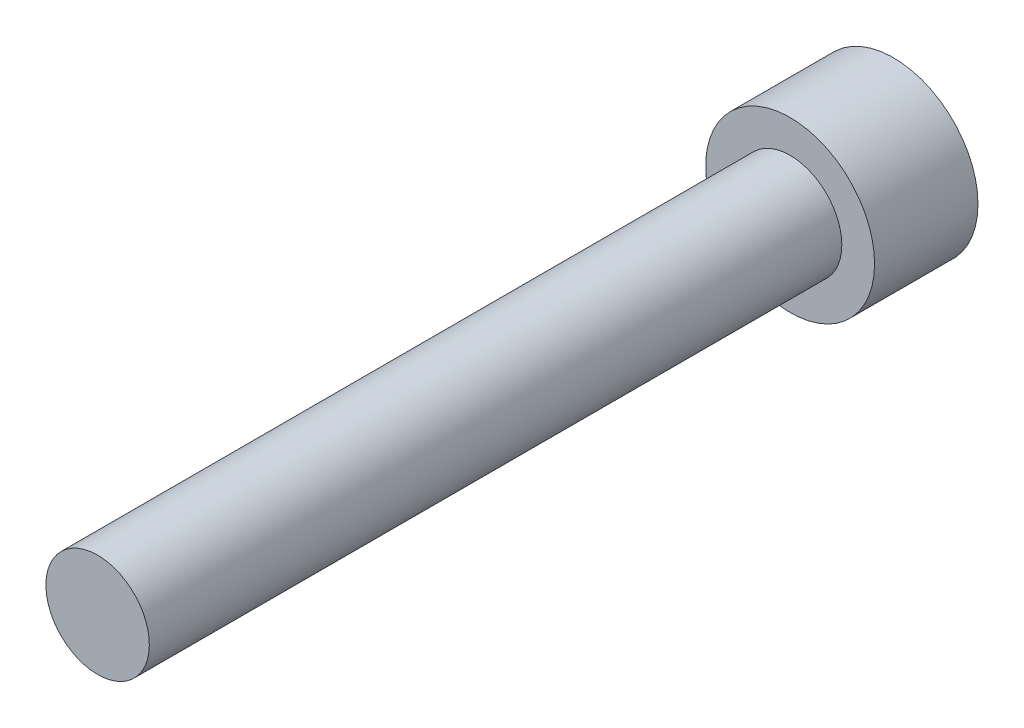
from build123d import *

# Parameters (mm, degrees)
HEX_2_DEPTH = 1.778


with BuildPart() as part:
    # Sketch6 → Revolve1 (revolve)
    with BuildSketch(Plane(origin=(0, 0, 0), x_dir=(0, 0, -1), z_dir=(1, 0, 0)), mode=Mode.PRIVATE) as revolve1_sk:
        Polygon((-19.05, 0), (-19.05, -1.4224), (0, -1.4224), (0, -2.3241), (2.8448, -2.3241), (2.8448, 0), align=None)
    revolve(revolve1_sk.sketch.rotate(Axis((0, 0, 19.05), (0, 0, -1)), 270), axis=Axis((0, 0, 19.05), (0, 0, -1)))

    # Sketch7 → HEX 2 (cut)
    with BuildSketch(Plane(origin=(0, 0, -2.8448), x_dir=(-1, 0, 0), z_dir=(0, 0, -1))):
        Polygon((-1.1811, 0.681908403), (-1.1811, -0.681908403), (0, -1.363816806), (1.1811, -0.681908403), (1.1811, 0.681908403), (0, 1.363816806), align=None)
    extrude(amount=-HEX_2_DEPTH, mode=Mode.SUBTRACT)


solid = part.part
